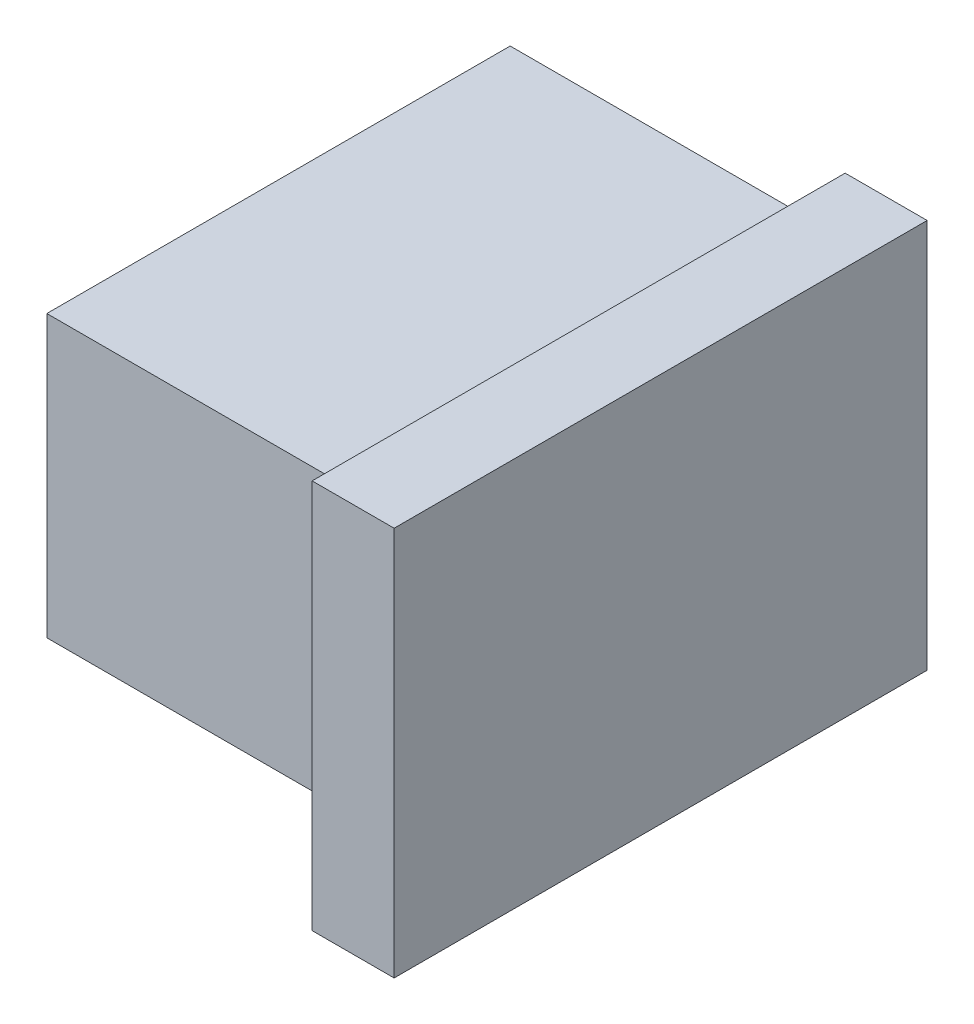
from build123d import *

# Parameters (mm, degrees)
SKETCH1_W           = 11.3
SKETCH1_H           = 8.4
BOSS_EXTRUDE1_DEPTH = 7.32
SKETCH_2_W          = 13
SKETCH_2_H          = 9.5
EXTRUDE_1_DEPTH     = 2
SKETCH2_W           = 11.3
SKETCH2_H           = 1.55
CUT_EXTRUDE1_DEPTH  = 7.32


with BuildPart() as part:
    # Sketch1 → Boss-Extrude1 (new body)
    with BuildSketch(Plane(origin=(0, 0, 0), x_dir=(0, 0, -1), z_dir=(1, 0, 0))):
        Rectangle(SKETCH1_W, SKETCH1_H)
        with BuildLine():
            Line((-1.413329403, -0.75), (-1.413329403, 0.75))
            ThreePointArc((-1.413329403, 0.75), (1.6, 0), (-1.413329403, -0.75))
        make_face(mode=Mode.SUBTRACT)
    extrude(amount=BOSS_EXTRUDE1_DEPTH)

    # Sketch 2 → Extrude 1 (add)
    with BuildSketch(Plane(origin=(7.32, 0, 0), x_dir=(0, 0, -1), z_dir=(1, 0, 0))):
        Rectangle(SKETCH_2_W, SKETCH_2_H)
    extrude(amount=EXTRUDE_1_DEPTH)

    # Sketch2 → Cut-Extrude1 (cut)
    with BuildSketch(Plane.ZY):
        with Locations((0, -3.425)):
            Rectangle(SKETCH2_W, SKETCH2_H)
    extrude(amount=-CUT_EXTRUDE1_DEPTH, mode=Mode.SUBTRACT)


solid = part.part
